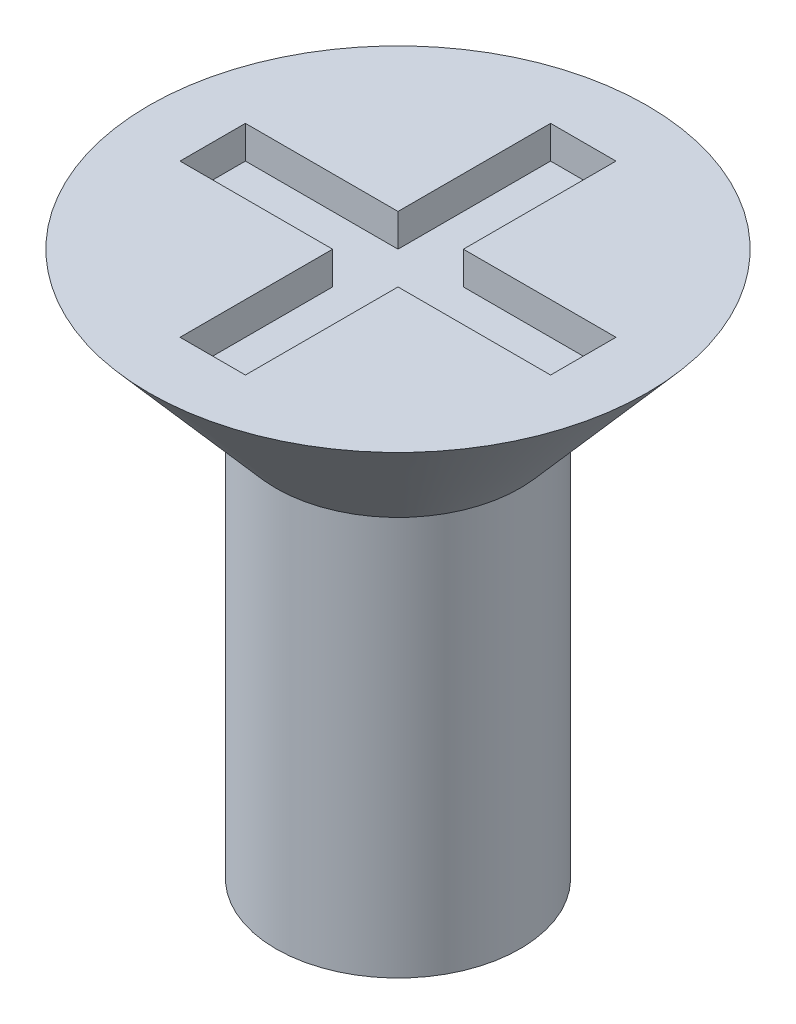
from build123d import *

# Parameters (mm, degrees)
SKETCH2_W              = 0.762
SKETCH2_H              = 2.159
PHILLIPS_DEPTH         = 0.381
PHILLIPS_PATTERN_COUNT = 4


with BuildPart() as part:
    # Sketch1 → FLATHEAD (revolve)
    with BuildSketch(Plane.XY, mode=Mode.PRIVATE) as flathead_sk:
        Polygon((0, 0), (1.4224, 0), (1.4224, 4.6482), (2.90175217, 6.35), (0, 6.35), align=None)
    revolve(flathead_sk.sketch.rotate(Axis((0, 90.869303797, 0), (0, -1, 0)), 90), axis=Axis((0, 90.869303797, 0), (0, -1, 0)))

    # Sketch2 → PHILLIPS (cut)
    with BuildSketch(Plane(origin=(0, 6.35, 0), x_dir=(-1, 0, 0), z_dir=(0, 1, 0))):
        with Locations((0, 1.0795)):
            Rectangle(SKETCH2_W, SKETCH2_H)
    phillips = extrude(amount=-PHILLIPS_DEPTH, mode=Mode.SUBTRACT)

    # PHILLIPS PATTERN: PHILLIPS ×4 about axis
    phillips_pattern_axis = Axis((0, 90.869303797, 0), (0, -1, 0))
    for i in range(1, PHILLIPS_PATTERN_COUNT):
        add(phillips.rotate(phillips_pattern_axis, i * 360 / PHILLIPS_PATTERN_COUNT), mode=Mode.SUBTRACT)


solid = part.part
